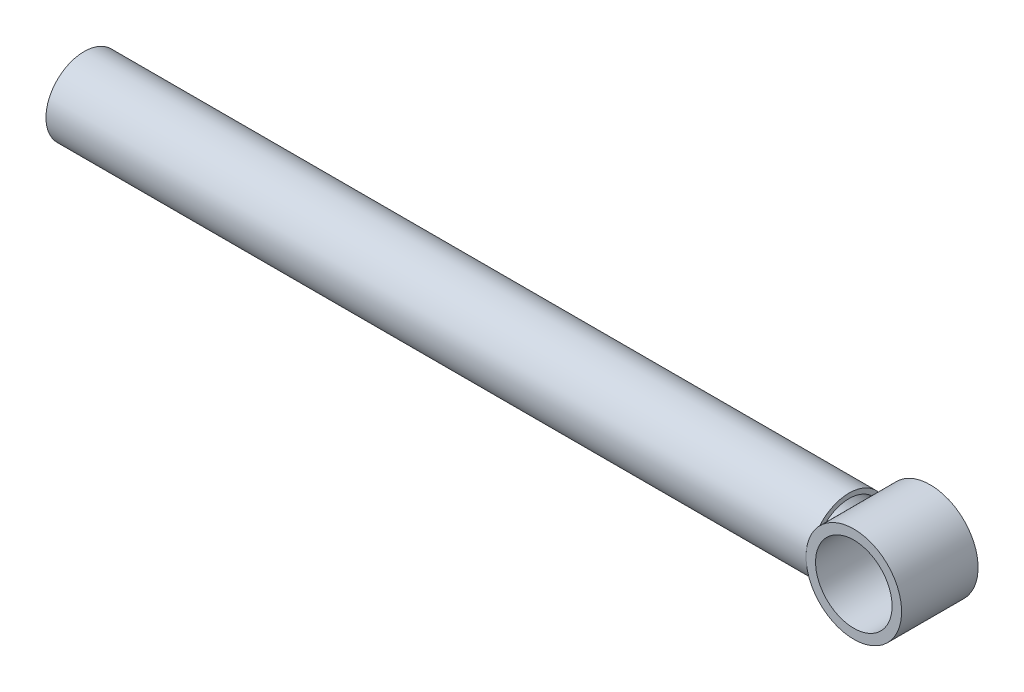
ISO-10303-21;
HEADER;
FILE_DESCRIPTION(('STEP AP214'),'2;1');
FILE_NAME('part.step','',(''),(''),'','','');
FILE_SCHEMA(('AUTOMOTIVE_DESIGN { 1 0 10303 214 1 1 1 1 }'));
ENDSEC;
DATA;
#1=APPLICATION_CONTEXT('core data for automotive mechanical design processes');
#2=APPLICATION_PROTOCOL_DEFINITION('international standard','automotive_design',2000,#1);
#3=PRODUCT_CONTEXT('',#1,'mechanical');
#4=PRODUCT('Part','Part','',(#3));
#5=PRODUCT_RELATED_PRODUCT_CATEGORY('part','',(#4));
#6=PRODUCT_DEFINITION_FORMATION('','',#4);
#7=PRODUCT_DEFINITION_CONTEXT('part definition',#1,'design');
#8=PRODUCT_DEFINITION('design','',#6,#7);
#9=PRODUCT_DEFINITION_SHAPE('','',#8);
#10=(LENGTH_UNIT() NAMED_UNIT(*) SI_UNIT(.MILLI.,.METRE.));
#11=(NAMED_UNIT(*) PLANE_ANGLE_UNIT() SI_UNIT($,.RADIAN.));
#12=(NAMED_UNIT(*) SI_UNIT($,.STERADIAN.) SOLID_ANGLE_UNIT());
#13=UNCERTAINTY_MEASURE_WITH_UNIT(LENGTH_MEASURE(1.E-05),#10,'distance_accuracy_value','');
#14=(GEOMETRIC_REPRESENTATION_CONTEXT(3) GLOBAL_UNCERTAINTY_ASSIGNED_CONTEXT((#13)) GLOBAL_UNIT_ASSIGNED_CONTEXT((#10,
#11,#12)) REPRESENTATION_CONTEXT('',''));
#15=CARTESIAN_POINT('',(0.,0.,0.));
#16=DIRECTION('',(0.,0.,1.));
#17=DIRECTION('',(1.,0.,0.));
#18=AXIS2_PLACEMENT_3D('',#15,#16,#17);
#19=CARTESIAN_POINT('',(0.,0.,50.8));
#20=DIRECTION('',(0.,0.,1.));
#21=DIRECTION('',(1.,0.,0.));
#22=AXIS2_PLACEMENT_3D('',#19,#20,#21);
#23=PLANE('',#22);
#24=CARTESIAN_POINT('',(0.,0.,50.8));
#25=DIRECTION('',(0.,0.,1.));
#26=DIRECTION('',(1.,0.,0.));
#27=AXIS2_PLACEMENT_3D('',#24,#25,#26);
#28=CIRCLE('',#27,63.5);
#29=CARTESIAN_POINT('',(-63.5,0.,50.8));
#30=VERTEX_POINT('',#29);
#31=EDGE_CURVE('E471',#30,#30,#28,.T.);
#32=ORIENTED_EDGE('',*,*,#31,.T.);
#33=EDGE_LOOP('',(#32));
#34=FACE_BOUND('',#33,.T.);
#35=CARTESIAN_POINT('',(0.,0.,50.8));
#36=DIRECTION('',(0.,0.,1.));
#37=DIRECTION('',(1.,0.,0.));
#38=AXIS2_PLACEMENT_3D('',#35,#36,#37);
#39=CIRCLE('',#38,50.8);
#40=CARTESIAN_POINT('',(50.8,0.,50.8));
#41=VERTEX_POINT('',#40);
#42=EDGE_CURVE('E468',#41,#41,#39,.T.);
#43=ORIENTED_EDGE('',*,*,#42,.F.);
#44=EDGE_LOOP('',(#43));
#45=FACE_BOUND('',#44,.T.);
#46=ADVANCED_FACE('F348',(#34,#45),#23,.T.);
#47=CARTESIAN_POINT('',(0.,0.,50.8));
#48=DIRECTION('',(0.,0.,-1.));
#49=DIRECTION('',(-1.,0.,0.));
#50=AXIS2_PLACEMENT_3D('',#47,#48,#49);
#51=CYLINDRICAL_SURFACE('',#50,63.5);
#52=CARTESIAN_POINT('',(0.,0.,-50.8));
#53=DIRECTION('',(0.,0.,1.));
#54=DIRECTION('',(1.,0.,0.));
#55=AXIS2_PLACEMENT_3D('',#52,#53,#54);
#56=CIRCLE('',#55,63.5);
#57=CARTESIAN_POINT('',(-63.5,0.,-50.8));
#58=VERTEX_POINT('',#57);
#59=EDGE_CURVE('E466',#58,#58,#56,.T.);
#60=ORIENTED_EDGE('',*,*,#59,.T.);
#61=CARTESIAN_POINT('',(-63.5,0.,-50.8));
#62=CARTESIAN_POINT('',(-63.500021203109,0.629312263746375,-50.8000202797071));
#63=CARTESIAN_POINT('',(-63.4906456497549,1.25861771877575,-50.7883068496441));
#64=CARTESIAN_POINT('',(-63.4532550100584,2.51578095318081,-50.7415602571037));
#65=CARTESIAN_POINT('',(-63.4252407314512,3.14363879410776,-50.7065281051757));
#66=CARTESIAN_POINT('',(-63.3507517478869,4.3961046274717,-50.6133232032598));
#67=CARTESIAN_POINT('',(-63.3042895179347,5.02071452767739,-50.5551660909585));
#68=CARTESIAN_POINT('',(-63.1932030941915,6.26575360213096,-50.4159963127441));
#69=CARTESIAN_POINT('',(-63.1285788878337,6.88618277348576,-50.3349836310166));
#70=CARTESIAN_POINT('',(-62.983629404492,8.10418840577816,-50.1530707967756));
#71=CARTESIAN_POINT('',(-62.9037970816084,8.70191667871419,-50.0527943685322));
#72=CARTESIAN_POINT('',(-62.7278055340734,9.89110416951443,-49.8314364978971));
#73=CARTESIAN_POINT('',(-62.6316445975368,10.4825627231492,-49.7103528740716));
#74=CARTESIAN_POINT('',(-62.3194467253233,12.2458243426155,-49.3166225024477));
#75=CARTESIAN_POINT('',(-62.0796566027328,13.4068305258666,-49.0134485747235));
#76=CARTESIAN_POINT('',(-61.5350198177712,15.7206940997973,-48.3217878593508));
#77=CARTESIAN_POINT('',(-61.2286863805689,16.8726093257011,-47.9313442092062));
#78=CARTESIAN_POINT('',(-60.5607991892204,19.1318515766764,-47.0751755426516));
#79=CARTESIAN_POINT('',(-60.1992287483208,20.2391649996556,-46.6094277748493));
#80=CARTESIAN_POINT('',(-59.4158574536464,22.4367337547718,-45.5932237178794));
#81=CARTESIAN_POINT('',(-58.9925743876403,23.5254792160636,-45.0406442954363));
#82=CARTESIAN_POINT('',(-58.3247966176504,25.1157058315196,-44.1611615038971));
#83=CARTESIAN_POINT('',(-58.0968091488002,25.6384673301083,-43.8596727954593));
#84=CARTESIAN_POINT('',(-57.6307521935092,26.6695774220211,-43.2404331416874));
#85=CARTESIAN_POINT('',(-57.3926838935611,27.1779276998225,-42.9226841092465));
#86=CARTESIAN_POINT('',(-57.15,27.6790082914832,-42.597094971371));
#87=B_SPLINE_CURVE_WITH_KNOTS('',3,(#61,#62,#63,#64,#65,#66,#67,#68,#69,#70,#71,#72,#73,#74,#75,
#76,#77,#78,#79,#80,#81,#82,#83,#84,#85,#86),.UNSPECIFIED.,.F.,.F.,(4,2,2,2,2,2,2,2,2,2,2,2,4),
(0.,1.88774713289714,3.77541246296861,5.66180347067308,7.5481957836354,9.38150963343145,
11.2150158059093,14.8810626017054,18.6394679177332,22.3990108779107,26.2714097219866,
28.2063325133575,30.1410281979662),.UNSPECIFIED.);
#88=CARTESIAN_POINT('',(-57.15,27.6790082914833,-42.597094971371));
#89=VERTEX_POINT('',#88);
#90=EDGE_CURVE('E375',#58,#89,#87,.T.);
#91=ORIENTED_EDGE('',*,*,#90,.T.);
#92=DIRECTION('',(0.,0.,-1.));
#93=VECTOR('',#92,1.);
#94=CARTESIAN_POINT('',(-57.15,27.6790082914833,50.8));
#95=LINE('',#94,#93);
#96=CARTESIAN_POINT('',(-57.15,27.6790082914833,-34.780382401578));
#97=VERTEX_POINT('',#96);
#98=EDGE_CURVE('E397',#89,#97,#95,.F.);
#99=ORIENTED_EDGE('',*,*,#98,.T.);
#100=CARTESIAN_POINT('',(-57.15,-27.6790082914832,-34.7803824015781));
#101=CARTESIAN_POINT('',(-57.3608962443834,-27.2435633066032,-35.1269111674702));
#102=CARTESIAN_POINT('',(-57.5691546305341,-26.8008738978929,-35.4658636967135));
#103=CARTESIAN_POINT('',(-57.9795220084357,-25.9011500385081,-36.1281770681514));
#104=CARTESIAN_POINT('',(-58.1816304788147,-25.4441143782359,-36.4515365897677));
#105=CARTESIAN_POINT('',(-58.7776050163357,-24.0512606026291,-37.397858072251));
#106=CARTESIAN_POINT('',(-59.1608656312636,-23.0942173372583,-37.9966470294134));
#107=CARTESIAN_POINT('',(-59.8938910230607,-21.1207683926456,-39.1282198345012));
#108=CARTESIAN_POINT('',(-60.2434302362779,-20.1040275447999,-39.6605653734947));
#109=CARTESIAN_POINT('',(-60.8989795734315,-18.0209845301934,-40.649418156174));
#110=CARTESIAN_POINT('',(-61.2050000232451,-16.9546942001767,-41.1059433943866));
#111=CARTESIAN_POINT('',(-61.7682326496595,-14.7720150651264,-41.9399834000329));
#112=CARTESIAN_POINT('',(-62.0251710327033,-13.6553858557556,-42.3170560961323));
#113=CARTESIAN_POINT('',(-62.4818378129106,-11.384677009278,-42.9836194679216));
#114=CARTESIAN_POINT('',(-62.6815623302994,-10.2305948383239,-43.2731042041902));
#115=CARTESIAN_POINT('',(-63.0179242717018,-7.89781057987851,-43.7589067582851));
#116=CARTESIAN_POINT('',(-63.1547614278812,-6.7191990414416,-43.9555195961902));
#117=CARTESIAN_POINT('',(-63.3624283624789,-4.34428538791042,-44.2533762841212));
#118=CARTESIAN_POINT('',(-63.4332671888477,-3.14798572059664,-44.354633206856));
#119=CARTESIAN_POINT('',(-63.5030389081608,-0.875702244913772,-44.4543520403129));
#120=CARTESIAN_POINT('',(-63.5087686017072,0.199661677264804,-44.4625306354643));
#121=CARTESIAN_POINT('',(-63.4656951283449,2.34701468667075,-44.4009851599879));
#122=CARTESIAN_POINT('',(-63.416895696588,3.41900400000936,-44.3312664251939));
#123=CARTESIAN_POINT('',(-63.2658562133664,5.55208119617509,-44.114929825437));
#124=CARTESIAN_POINT('',(-63.163580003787,6.61316120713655,-43.9682599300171));
#125=CARTESIAN_POINT('',(-62.9078997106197,8.71596148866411,-43.6001590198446));
#126=CARTESIAN_POINT('',(-62.7544958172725,9.75768183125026,-43.3787282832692));
#127=CARTESIAN_POINT('',(-62.4062122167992,11.7783000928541,-42.873302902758));
#128=CARTESIAN_POINT('',(-62.2129990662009,12.7581152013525,-42.5918095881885));
#129=CARTESIAN_POINT('',(-61.785815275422,14.6880874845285,-41.965366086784));
#130=CARTESIAN_POINT('',(-61.5518436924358,15.6382439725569,-41.6204144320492));
#131=CARTESIAN_POINT('',(-61.0473051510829,17.5046089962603,-40.8705626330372));
#132=CARTESIAN_POINT('',(-60.7767336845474,18.4208133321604,-40.4656551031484));
#133=CARTESIAN_POINT('',(-60.2035377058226,20.2156194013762,-39.599543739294));
#134=CARTESIAN_POINT('',(-59.9009185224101,21.0942273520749,-39.1383492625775));
#135=CARTESIAN_POINT('',(-59.3978527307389,22.4596823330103,-38.362812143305));
#136=CARTESIAN_POINT('',(-59.2062854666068,22.9596828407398,-38.0656282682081));
#137=CARTESIAN_POINT('',(-58.8146170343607,23.9451844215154,-37.4535310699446));
#138=CARTESIAN_POINT('',(-58.6145172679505,24.4306878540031,-37.138620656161));
#139=CARTESIAN_POINT('',(-58.2073867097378,25.3854014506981,-36.4926719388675));
#140=CARTESIAN_POINT('',(-58.000379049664,25.8546570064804,-36.1616860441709));
#141=CARTESIAN_POINT('',(-57.5798335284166,26.7781698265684,-35.4832407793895));
#142=CARTESIAN_POINT('',(-57.3662950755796,27.2324257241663,-35.1357799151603));
#143=CARTESIAN_POINT('',(-57.15,27.6790082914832,-34.7803824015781));
#144=B_SPLINE_CURVE_WITH_KNOTS('',3,(#100,#101,#102,#103,#104,#105,#106,#107,#108,#109,#110,
#111,#112,#113,#114,#115,#116,#117,#118,#119,#120,#121,#122,#123,#124,#125,#126,#127,#128,#129,
#130,#131,#132,#133,#134,#135,#136,#137,#138,#139,#140,#141,#142,#143),.UNSPECIFIED.,.F.,.F.,(4,
2,2,2,2,2,2,2,2,2,2,2,2,2,2,2,2,2,2,2,2,4),(0.,1.78517101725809,3.57049295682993,
7.14327365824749,10.7385002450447,14.3328723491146,17.9467440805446,21.5608608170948,
25.1634183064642,28.7654818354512,31.9875796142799,35.209456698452,38.4335150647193,
41.6575614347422,44.7671025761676,47.8767156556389,50.9867121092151,54.0961922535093,
55.9329226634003,57.7693524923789,59.6001517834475,61.4311174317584),.UNSPECIFIED.);
#145=CARTESIAN_POINT('',(-57.15,-27.6790082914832,-34.7803824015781));
#146=VERTEX_POINT('',#145);
#147=EDGE_CURVE('E11',#146,#97,#144,.T.);
#148=ORIENTED_EDGE('',*,*,#147,.F.);
#149=DIRECTION('',(0.,0.,-1.));
#150=VECTOR('',#149,1.);
#151=CARTESIAN_POINT('',(-57.15,-27.6790082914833,50.8));
#152=LINE('',#151,#150);
#153=CARTESIAN_POINT('',(-57.15,-27.6790082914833,-42.597094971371));
#154=VERTEX_POINT('',#153);
#155=EDGE_CURVE('E368',#146,#154,#152,.T.);
#156=ORIENTED_EDGE('',*,*,#155,.T.);
#157=CARTESIAN_POINT('',(-57.15,-27.6790082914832,-42.597094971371));
#158=CARTESIAN_POINT('',(-57.3878619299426,-27.187884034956,-42.9162151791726));
#159=CARTESIAN_POINT('',(-57.6212902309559,-26.6897751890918,-43.2278038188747));
#160=CARTESIAN_POINT('',(-58.0784800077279,-25.6797117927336,-43.835373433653));
#161=CARTESIAN_POINT('',(-58.3022404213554,-25.1677557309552,-44.1313526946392));
#162=CARTESIAN_POINT('',(-58.9579975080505,-23.610862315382,-44.9952917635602));
#163=CARTESIAN_POINT('',(-59.3741913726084,-22.5454715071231,-45.5388802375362));
#164=CARTESIAN_POINT('',(-60.1461193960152,-20.3951433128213,-46.5407851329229));
#165=CARTESIAN_POINT('',(-60.50323966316,-19.3116306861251,-47.0010918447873));
#166=CARTESIAN_POINT('',(-61.1647308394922,-17.1013471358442,-47.8496068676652));
#167=CARTESIAN_POINT('',(-61.4691145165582,-15.9745867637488,-48.2378326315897));
#168=CARTESIAN_POINT('',(-62.0233646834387,-13.6667329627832,-48.9421675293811));
#169=CARTESIAN_POINT('',(-62.2723881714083,-12.4850925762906,-49.2571644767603));
#170=CARTESIAN_POINT('',(-62.5967456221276,-10.6896276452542,-49.6663804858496));
#171=CARTESIAN_POINT('',(-62.6966792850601,-10.0872171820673,-49.7922527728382));
#172=CARTESIAN_POINT('',(-62.8796145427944,-8.87575802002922,-50.022403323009));
#173=CARTESIAN_POINT('',(-62.9626180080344,-8.26671006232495,-50.1266839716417));
#174=CARTESIAN_POINT('',(-63.1133924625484,-7.02511506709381,-50.315938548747));
#175=CARTESIAN_POINT('',(-63.1806427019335,-6.3924043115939,-50.4002532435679));
#176=CARTESIAN_POINT('',(-63.296256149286,-5.12254497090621,-50.5451079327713));
#177=CARTESIAN_POINT('',(-63.3446193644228,-4.48539638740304,-50.6056479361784));
#178=CARTESIAN_POINT('',(-63.4221629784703,-3.20764556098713,-50.7026789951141));
#179=CARTESIAN_POINT('',(-63.4513296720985,-2.56704117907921,-50.7391528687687));
#180=CARTESIAN_POINT('',(-63.4902601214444,-1.28429375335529,-50.7878249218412));
#181=CARTESIAN_POINT('',(-63.5000229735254,-0.642150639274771,-50.8000219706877));
#182=CARTESIAN_POINT('',(-63.5,0.,-50.8));
#183=B_SPLINE_CURVE_WITH_KNOTS('',3,(#157,#158,#159,#160,#161,#162,#163,#164,#165,#166,#167,
#168,#169,#170,#171,#172,#173,#174,#175,#176,#177,#178,#179,#180,#181,#182),.UNSPECIFIED.,.F.,
.F.,(4,2,2,2,2,2,2,2,2,2,2,2,4),(0.,1.89626304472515,3.79273388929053,7.58788167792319,
11.2747581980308,14.960740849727,18.6995008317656,20.5694175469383,22.4391275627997,
24.3639158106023,26.2887033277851,28.2148635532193,30.1411134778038),.UNSPECIFIED.);
#184=EDGE_CURVE('E429',#154,#58,#183,.T.);
#185=ORIENTED_EDGE('',*,*,#184,.T.);
#186=EDGE_LOOP('',(#60,#91,#99,#148,#156,#185));
#187=FACE_BOUND('',#186,.T.);
#188=ORIENTED_EDGE('',*,*,#31,.F.);
#189=CARTESIAN_POINT('',(-63.5,0.,50.8));
#190=CARTESIAN_POINT('',(-63.500021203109,-0.629312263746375,50.8000202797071));
#191=CARTESIAN_POINT('',(-63.4906456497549,-1.25861771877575,50.7883068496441));
#192=CARTESIAN_POINT('',(-63.4532550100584,-2.51578095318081,50.7415602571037));
#193=CARTESIAN_POINT('',(-63.4252407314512,-3.14363879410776,50.7065281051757));
#194=CARTESIAN_POINT('',(-63.3507517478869,-4.3961046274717,50.6133232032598));
#195=CARTESIAN_POINT('',(-63.3042895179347,-5.02071452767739,50.5551660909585));
#196=CARTESIAN_POINT('',(-63.1932030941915,-6.26575360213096,50.4159963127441));
#197=CARTESIAN_POINT('',(-63.1285788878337,-6.88618277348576,50.3349836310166));
#198=CARTESIAN_POINT('',(-62.983629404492,-8.10418840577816,50.1530707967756));
#199=CARTESIAN_POINT('',(-62.9037970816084,-8.70191667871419,50.0527943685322));
#200=CARTESIAN_POINT('',(-62.7278055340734,-9.89110416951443,49.8314364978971));
#201=CARTESIAN_POINT('',(-62.6316445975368,-10.4825627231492,49.7103528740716));
#202=CARTESIAN_POINT('',(-62.3194467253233,-12.2458243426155,49.3166225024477));
#203=CARTESIAN_POINT('',(-62.0796566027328,-13.4068305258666,49.0134485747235));
#204=CARTESIAN_POINT('',(-61.5350198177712,-15.7206940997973,48.3217878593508));
#205=CARTESIAN_POINT('',(-61.2286863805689,-16.8726093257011,47.9313442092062));
#206=CARTESIAN_POINT('',(-60.5607991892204,-19.1318515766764,47.0751755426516));
#207=CARTESIAN_POINT('',(-60.1992287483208,-20.2391649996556,46.6094277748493));
#208=CARTESIAN_POINT('',(-59.4158574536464,-22.4367337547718,45.5932237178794));
#209=CARTESIAN_POINT('',(-58.9925743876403,-23.5254792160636,45.0406442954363));
#210=CARTESIAN_POINT('',(-58.3247966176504,-25.1157058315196,44.1611615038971));
#211=CARTESIAN_POINT('',(-58.0968091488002,-25.6384673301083,43.8596727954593));
#212=CARTESIAN_POINT('',(-57.6307521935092,-26.6695774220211,43.2404331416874));
#213=CARTESIAN_POINT('',(-57.3926838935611,-27.1779276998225,42.9226841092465));
#214=CARTESIAN_POINT('',(-57.15,-27.6790082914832,42.597094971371));
#215=B_SPLINE_CURVE_WITH_KNOTS('',3,(#189,#190,#191,#192,#193,#194,#195,#196,#197,#198,#199,
#200,#201,#202,#203,#204,#205,#206,#207,#208,#209,#210,#211,#212,#213,#214),.UNSPECIFIED.,.F.,
.F.,(4,2,2,2,2,2,2,2,2,2,2,2,4),(0.,1.88774713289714,3.77541246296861,5.66180347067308,
7.5481957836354,9.38150963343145,11.2150158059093,14.8810626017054,18.6394679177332,
22.3990108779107,26.2714097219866,28.2063325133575,30.1410281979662),.UNSPECIFIED.);
#216=CARTESIAN_POINT('',(-57.15,-27.6790082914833,42.597094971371));
#217=VERTEX_POINT('',#216);
#218=EDGE_CURVE('E455',#30,#217,#215,.T.);
#219=ORIENTED_EDGE('',*,*,#218,.T.);
#220=CARTESIAN_POINT('',(-57.15,-27.6790082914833,34.780382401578));
#221=VERTEX_POINT('',#220);
#222=EDGE_CURVE('E428',#217,#221,#152,.T.);
#223=ORIENTED_EDGE('',*,*,#222,.T.);
#224=CARTESIAN_POINT('',(-57.15,27.6790082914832,34.7803824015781));
#225=CARTESIAN_POINT('',(-57.3608962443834,27.2435633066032,35.1269111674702));
#226=CARTESIAN_POINT('',(-57.5691546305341,26.8008738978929,35.4658636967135));
#227=CARTESIAN_POINT('',(-57.9795220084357,25.9011500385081,36.1281770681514));
#228=CARTESIAN_POINT('',(-58.1816304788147,25.4441143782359,36.4515365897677));
#229=CARTESIAN_POINT('',(-58.7776050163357,24.0512606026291,37.397858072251));
#230=CARTESIAN_POINT('',(-59.1608656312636,23.0942173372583,37.9966470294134));
#231=CARTESIAN_POINT('',(-59.8938910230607,21.1207683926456,39.1282198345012));
#232=CARTESIAN_POINT('',(-60.2434302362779,20.1040275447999,39.6605653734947));
#233=CARTESIAN_POINT('',(-60.8989795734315,18.0209845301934,40.649418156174));
#234=CARTESIAN_POINT('',(-61.2050000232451,16.9546942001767,41.1059433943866));
#235=CARTESIAN_POINT('',(-61.7682326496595,14.7720150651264,41.9399834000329));
#236=CARTESIAN_POINT('',(-62.0251710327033,13.6553858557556,42.3170560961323));
#237=CARTESIAN_POINT('',(-62.4818378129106,11.384677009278,42.9836194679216));
#238=CARTESIAN_POINT('',(-62.6815623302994,10.2305948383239,43.2731042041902));
#239=CARTESIAN_POINT('',(-63.0179242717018,7.89781057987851,43.7589067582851));
#240=CARTESIAN_POINT('',(-63.1547614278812,6.7191990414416,43.9555195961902));
#241=CARTESIAN_POINT('',(-63.3624283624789,4.34428538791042,44.2533762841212));
#242=CARTESIAN_POINT('',(-63.4332671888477,3.14798572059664,44.354633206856));
#243=CARTESIAN_POINT('',(-63.5030389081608,0.875702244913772,44.4543520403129));
#244=CARTESIAN_POINT('',(-63.5087686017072,-0.199661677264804,44.4625306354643));
#245=CARTESIAN_POINT('',(-63.4656951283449,-2.34701468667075,44.4009851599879));
#246=CARTESIAN_POINT('',(-63.416895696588,-3.41900400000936,44.3312664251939));
#247=CARTESIAN_POINT('',(-63.2658562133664,-5.55208119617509,44.114929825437));
#248=CARTESIAN_POINT('',(-63.163580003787,-6.61316120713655,43.9682599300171));
#249=CARTESIAN_POINT('',(-62.9078997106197,-8.71596148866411,43.6001590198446));
#250=CARTESIAN_POINT('',(-62.7544958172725,-9.75768183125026,43.3787282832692));
#251=CARTESIAN_POINT('',(-62.4062122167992,-11.7783000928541,42.873302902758));
#252=CARTESIAN_POINT('',(-62.2129990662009,-12.7581152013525,42.5918095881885));
#253=CARTESIAN_POINT('',(-61.785815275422,-14.6880874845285,41.965366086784));
#254=CARTESIAN_POINT('',(-61.5518436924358,-15.6382439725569,41.6204144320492));
#255=CARTESIAN_POINT('',(-61.0473051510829,-17.5046089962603,40.8705626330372));
#256=CARTESIAN_POINT('',(-60.7767336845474,-18.4208133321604,40.4656551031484));
#257=CARTESIAN_POINT('',(-60.2035377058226,-20.2156194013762,39.599543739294));
#258=CARTESIAN_POINT('',(-59.9009185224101,-21.0942273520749,39.1383492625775));
#259=CARTESIAN_POINT('',(-59.3978527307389,-22.4596823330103,38.362812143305));
#260=CARTESIAN_POINT('',(-59.2062854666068,-22.9596828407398,38.0656282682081));
#261=CARTESIAN_POINT('',(-58.8146170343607,-23.9451844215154,37.4535310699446));
#262=CARTESIAN_POINT('',(-58.6145172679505,-24.4306878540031,37.138620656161));
#263=CARTESIAN_POINT('',(-58.2073867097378,-25.3854014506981,36.4926719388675));
#264=CARTESIAN_POINT('',(-58.000379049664,-25.8546570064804,36.1616860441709));
#265=CARTESIAN_POINT('',(-57.5798335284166,-26.7781698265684,35.4832407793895));
#266=CARTESIAN_POINT('',(-57.3662950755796,-27.2324257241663,35.1357799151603));
#267=CARTESIAN_POINT('',(-57.15,-27.6790082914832,34.7803824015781));
#268=B_SPLINE_CURVE_WITH_KNOTS('',3,(#224,#225,#226,#227,#228,#229,#230,#231,#232,#233,#234,
#235,#236,#237,#238,#239,#240,#241,#242,#243,#244,#245,#246,#247,#248,#249,#250,#251,#252,#253,
#254,#255,#256,#257,#258,#259,#260,#261,#262,#263,#264,#265,#266,#267),.UNSPECIFIED.,.F.,.F.,(4,
2,2,2,2,2,2,2,2,2,2,2,2,2,2,2,2,2,2,2,2,4),(0.,1.78517101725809,3.57049295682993,
7.14327365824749,10.7385002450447,14.3328723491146,17.9467440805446,21.5608608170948,
25.1634183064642,28.7654818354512,31.9875796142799,35.209456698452,38.4335150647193,
41.6575614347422,44.7671025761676,47.8767156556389,50.9867121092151,54.0961922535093,
55.9329226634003,57.7693524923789,59.6001517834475,61.4311174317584),.UNSPECIFIED.);
#269=CARTESIAN_POINT('',(-57.15,27.6790082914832,34.7803824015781));
#270=VERTEX_POINT('',#269);
#271=EDGE_CURVE('E361',#270,#221,#268,.T.);
#272=ORIENTED_EDGE('',*,*,#271,.F.);
#273=CARTESIAN_POINT('',(-57.15,27.6790082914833,42.597094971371));
#274=VERTEX_POINT('',#273);
#275=EDGE_CURVE('E403',#270,#274,#95,.F.);
#276=ORIENTED_EDGE('',*,*,#275,.T.);
#277=CARTESIAN_POINT('',(-57.15,27.6790082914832,42.597094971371));
#278=CARTESIAN_POINT('',(-57.3878619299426,27.187884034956,42.9162151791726));
#279=CARTESIAN_POINT('',(-57.6212902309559,26.6897751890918,43.2278038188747));
#280=CARTESIAN_POINT('',(-58.0784800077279,25.6797117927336,43.835373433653));
#281=CARTESIAN_POINT('',(-58.3022404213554,25.1677557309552,44.1313526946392));
#282=CARTESIAN_POINT('',(-58.9579975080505,23.610862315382,44.9952917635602));
#283=CARTESIAN_POINT('',(-59.3741913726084,22.5454715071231,45.5388802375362));
#284=CARTESIAN_POINT('',(-60.1461193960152,20.3951433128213,46.5407851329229));
#285=CARTESIAN_POINT('',(-60.50323966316,19.3116306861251,47.0010918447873));
#286=CARTESIAN_POINT('',(-61.1647308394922,17.1013471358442,47.8496068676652));
#287=CARTESIAN_POINT('',(-61.4691145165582,15.9745867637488,48.2378326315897));
#288=CARTESIAN_POINT('',(-62.0233646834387,13.6667329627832,48.9421675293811));
#289=CARTESIAN_POINT('',(-62.2723881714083,12.4850925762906,49.2571644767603));
#290=CARTESIAN_POINT('',(-62.5967456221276,10.6896276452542,49.6663804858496));
#291=CARTESIAN_POINT('',(-62.6966792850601,10.0872171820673,49.7922527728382));
#292=CARTESIAN_POINT('',(-62.8796145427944,8.87575802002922,50.022403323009));
#293=CARTESIAN_POINT('',(-62.9626180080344,8.26671006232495,50.1266839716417));
#294=CARTESIAN_POINT('',(-63.1133924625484,7.02511506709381,50.315938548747));
#295=CARTESIAN_POINT('',(-63.1806427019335,6.3924043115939,50.4002532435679));
#296=CARTESIAN_POINT('',(-63.296256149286,5.12254497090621,50.5451079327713));
#297=CARTESIAN_POINT('',(-63.3446193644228,4.48539638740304,50.6056479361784));
#298=CARTESIAN_POINT('',(-63.4221629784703,3.20764556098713,50.7026789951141));
#299=CARTESIAN_POINT('',(-63.4513296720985,2.56704117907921,50.7391528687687));
#300=CARTESIAN_POINT('',(-63.4902601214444,1.28429375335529,50.7878249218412));
#301=CARTESIAN_POINT('',(-63.5000229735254,0.642150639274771,50.8000219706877));
#302=CARTESIAN_POINT('',(-63.5,0.,50.8));
#303=B_SPLINE_CURVE_WITH_KNOTS('',3,(#277,#278,#279,#280,#281,#282,#283,#284,#285,#286,#287,
#288,#289,#290,#291,#292,#293,#294,#295,#296,#297,#298,#299,#300,#301,#302),.UNSPECIFIED.,.F.,
.F.,(4,2,2,2,2,2,2,2,2,2,2,2,4),(0.,1.89626304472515,3.79273388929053,7.58788167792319,
11.2747581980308,14.960740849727,18.6995008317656,20.5694175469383,22.4391275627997,
24.3639158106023,26.2887033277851,28.2148635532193,30.1411134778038),.UNSPECIFIED.);
#304=EDGE_CURVE('E435',#274,#30,#303,.T.);
#305=ORIENTED_EDGE('',*,*,#304,.T.);
#306=EDGE_LOOP('',(#188,#219,#223,#272,#276,#305));
#307=FACE_BOUND('',#306,.T.);
#308=ADVANCED_FACE('F350',(#187,#307),#51,.T.);
#309=CARTESIAN_POINT('',(0.,0.,50.8));
#310=DIRECTION('',(0.,0.,-1.));
#311=DIRECTION('',(-1.,0.,0.));
#312=AXIS2_PLACEMENT_3D('',#309,#310,#311);
#313=CYLINDRICAL_SURFACE('',#312,50.8);
#314=ORIENTED_EDGE('',*,*,#42,.T.);
#315=EDGE_LOOP('',(#314));
#316=FACE_BOUND('',#315,.T.);
#317=CARTESIAN_POINT('',(0.,0.,-50.8));
#318=DIRECTION('',(0.,0.,1.));
#319=DIRECTION('',(1.,0.,0.));
#320=AXIS2_PLACEMENT_3D('',#317,#318,#319);
#321=CIRCLE('',#320,50.8);
#322=CARTESIAN_POINT('',(50.8,0.,-50.8));
#323=VERTEX_POINT('',#322);
#324=EDGE_CURVE('E463',#323,#323,#321,.T.);
#325=ORIENTED_EDGE('',*,*,#324,.F.);
#326=EDGE_LOOP('',(#325));
#327=FACE_BOUND('',#326,.T.);
#328=ADVANCED_FACE('F491',(#316,#327),#313,.F.);
#329=CARTESIAN_POINT('',(0.,0.,-50.8));
#330=DIRECTION('',(0.,0.,1.));
#331=DIRECTION('',(1.,0.,0.));
#332=AXIS2_PLACEMENT_3D('',#329,#330,#331);
#333=PLANE('',#332);
#334=ORIENTED_EDGE('',*,*,#324,.T.);
#335=EDGE_LOOP('',(#334));
#336=FACE_BOUND('',#335,.T.);
#337=ORIENTED_EDGE('',*,*,#59,.F.);
#338=EDGE_LOOP('',(#337));
#339=FACE_BOUND('',#338,.T.);
#340=ADVANCED_FACE('F449',(#336,#339),#333,.F.);
#341=CARTESIAN_POINT('',(-1073.15,0.,0.));
#342=DIRECTION('',(1.,0.,0.));
#343=DIRECTION('',(0.,0.,-1.));
#344=AXIS2_PLACEMENT_3D('',#341,#342,#343);
#345=CYLINDRICAL_SURFACE('',#344,44.45);
#346=CARTESIAN_POINT('',(-1073.15,0.,0.));
#347=DIRECTION('',(1.,0.,0.));
#348=DIRECTION('',(0.,0.,-1.));
#349=AXIS2_PLACEMENT_3D('',#346,#347,#348);
#350=CIRCLE('',#349,44.45);
#351=CARTESIAN_POINT('',(-1073.15,0.,-44.45));
#352=VERTEX_POINT('',#351);
#353=EDGE_CURVE('E415',#352,#352,#350,.T.);
#354=ORIENTED_EDGE('',*,*,#353,.F.);
#355=EDGE_LOOP('',(#354));
#356=FACE_BOUND('',#355,.T.);
#357=CARTESIAN_POINT('',(-57.15,0.,0.));
#358=DIRECTION('',(1.,0.,0.));
#359=DIRECTION('',(0.,0.,-1.));
#360=AXIS2_PLACEMENT_3D('',#357,#358,#359);
#361=CIRCLE('',#360,44.45);
#362=EDGE_CURVE('E412',#221,#146,#361,.T.);
#363=ORIENTED_EDGE('',*,*,#362,.T.);
#364=ORIENTED_EDGE('',*,*,#147,.T.);
#365=EDGE_CURVE('E410',#97,#270,#361,.T.);
#366=ORIENTED_EDGE('',*,*,#365,.T.);
#367=ORIENTED_EDGE('',*,*,#271,.T.);
#368=EDGE_LOOP('',(#363,#364,#366,#367));
#369=FACE_BOUND('',#368,.T.);
#370=ADVANCED_FACE('F408',(#356,#369),#345,.F.);
#371=CARTESIAN_POINT('',(-1073.15,0.,0.));
#372=DIRECTION('',(1.,0.,0.));
#373=DIRECTION('',(0.,0.,-1.));
#374=AXIS2_PLACEMENT_3D('',#371,#372,#373);
#375=CYLINDRICAL_SURFACE('',#374,50.8);
#376=CARTESIAN_POINT('',(-1073.15,0.,0.));
#377=DIRECTION('',(1.,0.,0.));
#378=DIRECTION('',(0.,0.,-1.));
#379=AXIS2_PLACEMENT_3D('',#376,#377,#378);
#380=CIRCLE('',#379,50.8);
#381=CARTESIAN_POINT('',(-1073.15,0.,-50.8));
#382=VERTEX_POINT('',#381);
#383=EDGE_CURVE('E424',#382,#382,#380,.T.);
#384=ORIENTED_EDGE('',*,*,#383,.T.);
#385=EDGE_LOOP('',(#384));
#386=FACE_BOUND('',#385,.T.);
#387=ORIENTED_EDGE('',*,*,#90,.F.);
#388=ORIENTED_EDGE('',*,*,#184,.F.);
#389=CARTESIAN_POINT('',(-57.15,0.,0.));
#390=DIRECTION('',(1.,0.,0.));
#391=DIRECTION('',(0.,0.,-1.));
#392=AXIS2_PLACEMENT_3D('',#389,#390,#391);
#393=CIRCLE('',#392,50.8);
#394=EDGE_CURVE('E418',#217,#154,#393,.T.);
#395=ORIENTED_EDGE('',*,*,#394,.F.);
#396=ORIENTED_EDGE('',*,*,#218,.F.);
#397=ORIENTED_EDGE('',*,*,#304,.F.);
#398=EDGE_CURVE('E423',#89,#274,#393,.T.);
#399=ORIENTED_EDGE('',*,*,#398,.F.);
#400=EDGE_LOOP('',(#387,#388,#395,#396,#397,#399));
#401=FACE_BOUND('',#400,.T.);
#402=ADVANCED_FACE('F440',(#386,#401),#375,.T.);
#403=CARTESIAN_POINT('',(-57.15,0.,0.));
#404=DIRECTION('',(1.,0.,0.));
#405=DIRECTION('',(0.,0.,-1.));
#406=AXIS2_PLACEMENT_3D('',#403,#404,#405);
#407=PLANE('',#406);
#408=ORIENTED_EDGE('',*,*,#222,.F.);
#409=ORIENTED_EDGE('',*,*,#394,.T.);
#410=ORIENTED_EDGE('',*,*,#155,.F.);
#411=ORIENTED_EDGE('',*,*,#362,.F.);
#412=EDGE_LOOP('',(#408,#409,#410,#411));
#413=FACE_BOUND('',#412,.T.);
#414=ADVANCED_FACE('F445',(#413),#407,.T.);
#415=ORIENTED_EDGE('',*,*,#98,.F.);
#416=ORIENTED_EDGE('',*,*,#398,.T.);
#417=ORIENTED_EDGE('',*,*,#275,.F.);
#418=ORIENTED_EDGE('',*,*,#365,.F.);
#419=EDGE_LOOP('',(#415,#416,#417,#418));
#420=FACE_BOUND('',#419,.T.);
#421=ADVANCED_FACE('F414',(#420),#407,.T.);
#422=CARTESIAN_POINT('',(-1073.15,0.,0.));
#423=DIRECTION('',(1.,0.,0.));
#424=DIRECTION('',(0.,0.,-1.));
#425=AXIS2_PLACEMENT_3D('',#422,#423,#424);
#426=PLANE('',#425);
#427=ORIENTED_EDGE('',*,*,#353,.T.);
#428=EDGE_LOOP('',(#427));
#429=FACE_BOUND('',#428,.T.);
#430=ORIENTED_EDGE('',*,*,#383,.F.);
#431=EDGE_LOOP('',(#430));
#432=FACE_BOUND('',#431,.T.);
#433=ADVANCED_FACE('F447',(#429,#432),#426,.F.);
#434=CLOSED_SHELL('',(#46,#308,#328,#340,#370,#402,#414,#421,#433));
#435=MANIFOLD_SOLID_BREP('B2',#434);
#436=ADVANCED_BREP_SHAPE_REPRESENTATION('',(#18,#435),#14);
#437=SHAPE_DEFINITION_REPRESENTATION(#9,#436);
ENDSEC;
END-ISO-10303-21;
